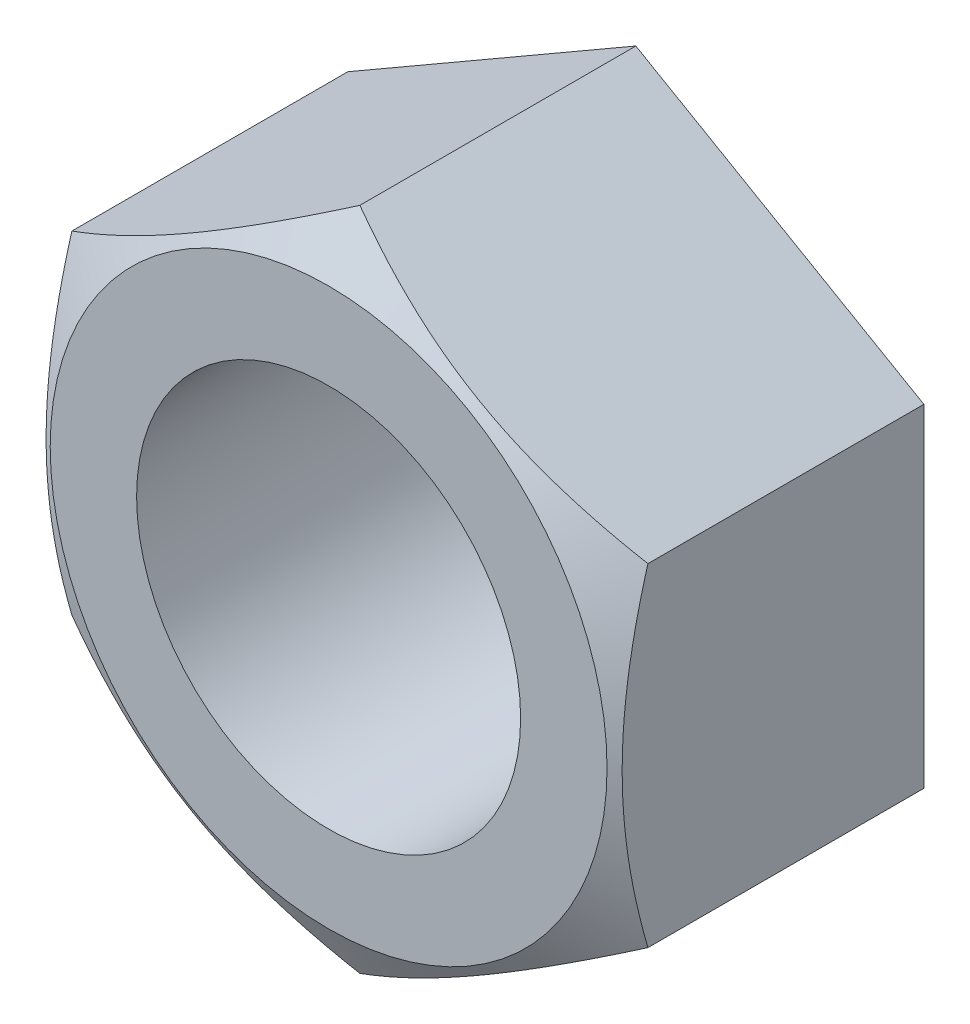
ISO-10303-21;
HEADER;
FILE_DESCRIPTION(('STEP AP214'),'2;1');
FILE_NAME('part.step','',(''),(''),'','','');
FILE_SCHEMA(('AUTOMOTIVE_DESIGN { 1 0 10303 214 1 1 1 1 }'));
ENDSEC;
DATA;
#1=APPLICATION_CONTEXT('core data for automotive mechanical design processes');
#2=APPLICATION_PROTOCOL_DEFINITION('international standard','automotive_design',2000,#1);
#3=PRODUCT_CONTEXT('',#1,'mechanical');
#4=PRODUCT('Part','Part','',(#3));
#5=PRODUCT_RELATED_PRODUCT_CATEGORY('part','',(#4));
#6=PRODUCT_DEFINITION_FORMATION('','',#4);
#7=PRODUCT_DEFINITION_CONTEXT('part definition',#1,'design');
#8=PRODUCT_DEFINITION('design','',#6,#7);
#9=PRODUCT_DEFINITION_SHAPE('','',#8);
#10=(LENGTH_UNIT() NAMED_UNIT(*) SI_UNIT(.MILLI.,.METRE.));
#11=(NAMED_UNIT(*) PLANE_ANGLE_UNIT() SI_UNIT($,.RADIAN.));
#12=(NAMED_UNIT(*) SI_UNIT($,.STERADIAN.) SOLID_ANGLE_UNIT());
#13=UNCERTAINTY_MEASURE_WITH_UNIT(LENGTH_MEASURE(1.E-05),#10,'distance_accuracy_value','');
#14=(GEOMETRIC_REPRESENTATION_CONTEXT(3) GLOBAL_UNCERTAINTY_ASSIGNED_CONTEXT((#13)) GLOBAL_UNIT_ASSIGNED_CONTEXT((#10,
#11,#12)) REPRESENTATION_CONTEXT('',''));
#15=CARTESIAN_POINT('',(0.,0.,0.));
#16=DIRECTION('',(0.,0.,1.));
#17=DIRECTION('',(1.,0.,0.));
#18=AXIS2_PLACEMENT_3D('',#15,#16,#17);
#19=CARTESIAN_POINT('',(30.,0.,16.));
#20=DIRECTION('',(0.,0.,-1.));
#21=DIRECTION('',(-1.,0.,0.));
#22=AXIS2_PLACEMENT_3D('',#19,#20,#21);
#23=PLANE('',#22);
#24=CARTESIAN_POINT('',(0.,0.,16.));
#25=DIRECTION('',(0.,0.,-1.));
#26=DIRECTION('',(-1.,0.,0.));
#27=AXIS2_PLACEMENT_3D('',#24,#25,#26);
#28=CIRCLE('',#27,14.5);
#29=CARTESIAN_POINT('',(-14.5,0.,16.));
#30=VERTEX_POINT('',#29);
#31=EDGE_CURVE('E171',#30,#30,#28,.T.);
#32=ORIENTED_EDGE('',*,*,#31,.F.);
#33=EDGE_LOOP('',(#32));
#34=FACE_BOUND('',#33,.T.);
#35=CARTESIAN_POINT('',(0.,0.,16.));
#36=DIRECTION('',(0.,0.,1.));
#37=DIRECTION('',(1.,0.,0.));
#38=AXIS2_PLACEMENT_3D('',#35,#36,#37);
#39=CIRCLE('',#38,10.);
#40=CARTESIAN_POINT('',(10.,0.,16.));
#41=VERTEX_POINT('',#40);
#42=EDGE_CURVE('E112',#41,#41,#39,.T.);
#43=ORIENTED_EDGE('',*,*,#42,.F.);
#44=EDGE_LOOP('',(#43));
#45=FACE_BOUND('',#44,.T.);
#46=ADVANCED_FACE('F14',(#34,#45),#23,.F.);
#47=CARTESIAN_POINT('',(30.,0.,0.));
#48=DIRECTION('',(0.,0.,-1.));
#49=DIRECTION('',(-1.,0.,0.));
#50=AXIS2_PLACEMENT_3D('',#47,#48,#49);
#51=PLANE('',#50);
#52=DIRECTION('',(-0.866025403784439,0.5,0.));
#53=VECTOR('',#52,1.);
#54=CARTESIAN_POINT('',(15.,8.6602540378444,0.));
#55=LINE('',#54,#53);
#56=CARTESIAN_POINT('',(15.,8.6602540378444,0.));
#57=VERTEX_POINT('',#56);
#58=CARTESIAN_POINT('',(0.,17.3205080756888,0.));
#59=VERTEX_POINT('',#58);
#60=EDGE_CURVE('E107',#57,#59,#55,.T.);
#61=ORIENTED_EDGE('',*,*,#60,.F.);
#62=DIRECTION('',(0.,1.,0.));
#63=VECTOR('',#62,1.);
#64=CARTESIAN_POINT('',(15.,-8.66025403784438,0.));
#65=LINE('',#64,#63);
#66=CARTESIAN_POINT('',(15.,-8.66025403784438,0.));
#67=VERTEX_POINT('',#66);
#68=EDGE_CURVE('E83',#67,#57,#65,.T.);
#69=ORIENTED_EDGE('',*,*,#68,.F.);
#70=DIRECTION('',(0.866025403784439,0.5,0.));
#71=VECTOR('',#70,1.);
#72=CARTESIAN_POINT('',(0.,-17.3205080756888,0.));
#73=LINE('',#72,#71);
#74=CARTESIAN_POINT('',(0.,-17.3205080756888,0.));
#75=VERTEX_POINT('',#74);
#76=EDGE_CURVE('E89',#75,#67,#73,.T.);
#77=ORIENTED_EDGE('',*,*,#76,.F.);
#78=DIRECTION('',(0.866025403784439,-0.5,0.));
#79=VECTOR('',#78,1.);
#80=CARTESIAN_POINT('',(-15.,-8.66025403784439,0.));
#81=LINE('',#80,#79);
#82=CARTESIAN_POINT('',(-15.,-8.66025403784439,0.));
#83=VERTEX_POINT('',#82);
#84=EDGE_CURVE('E119',#83,#75,#81,.T.);
#85=ORIENTED_EDGE('',*,*,#84,.F.);
#86=DIRECTION('',(0.,-1.,0.));
#87=VECTOR('',#86,1.);
#88=CARTESIAN_POINT('',(-15.,8.66025403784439,0.));
#89=LINE('',#88,#87);
#90=CARTESIAN_POINT('',(-15.,8.66025403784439,0.));
#91=VERTEX_POINT('',#90);
#92=EDGE_CURVE('E110',#91,#83,#89,.T.);
#93=ORIENTED_EDGE('',*,*,#92,.F.);
#94=DIRECTION('',(-0.866025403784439,-0.5,0.));
#95=VECTOR('',#94,1.);
#96=CARTESIAN_POINT('',(0.,17.3205080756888,0.));
#97=LINE('',#96,#95);
#98=EDGE_CURVE('E102',#59,#91,#97,.T.);
#99=ORIENTED_EDGE('',*,*,#98,.F.);
#100=EDGE_LOOP('',(#61,#69,#77,#85,#93,#99));
#101=FACE_BOUND('',#100,.T.);
#102=CARTESIAN_POINT('',(0.,0.,0.));
#103=DIRECTION('',(0.,0.,1.));
#104=DIRECTION('',(1.,0.,0.));
#105=AXIS2_PLACEMENT_3D('',#102,#103,#104);
#106=CIRCLE('',#105,10.);
#107=CARTESIAN_POINT('',(10.,0.,0.));
#108=VERTEX_POINT('',#107);
#109=EDGE_CURVE('E78',#108,#108,#106,.T.);
#110=ORIENTED_EDGE('',*,*,#109,.T.);
#111=EDGE_LOOP('',(#110));
#112=FACE_BOUND('',#111,.T.);
#113=ADVANCED_FACE('F105',(#101,#112),#51,.T.);
#114=CARTESIAN_POINT('',(15.,8.6602540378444,16.));
#115=DIRECTION('',(-0.5,-0.866025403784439,0.));
#116=DIRECTION('',(0.866025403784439,-0.5,0.));
#117=AXIS2_PLACEMENT_3D('',#114,#115,#116);
#118=PLANE('',#117);
#119=DIRECTION('',(0.,0.,-1.));
#120=VECTOR('',#119,1.);
#121=CARTESIAN_POINT('',(0.,17.3205080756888,16.));
#122=LINE('',#121,#120);
#123=CARTESIAN_POINT('',(0.,17.3205080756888,14.3715789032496));
#124=VERTEX_POINT('',#123);
#125=EDGE_CURVE('E29',#124,#59,#122,.T.);
#126=ORIENTED_EDGE('',*,*,#125,.F.);
#127=CARTESIAN_POINT('',(-0.000199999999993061,17.3206235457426,14.3715122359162));
#128=CARTESIAN_POINT('',(0.32949410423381,17.130274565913,14.4814030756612));
#129=CARTESIAN_POINT('',(0.660474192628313,16.939183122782,14.5863072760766));
#130=CARTESIAN_POINT('',(1.32508844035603,16.5554679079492,14.7847562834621));
#131=CARTESIAN_POINT('',(1.65872343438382,16.3628436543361,14.8782973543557));
#132=CARTESIAN_POINT('',(2.32929228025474,15.9756905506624,15.0527627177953));
#133=CARTESIAN_POINT('',(2.66623200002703,15.7811583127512,15.133657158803));
#134=CARTESIAN_POINT('',(3.3424527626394,15.3907420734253,15.2810922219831));
#135=CARTESIAN_POINT('',(3.68173367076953,15.1948581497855,15.3476336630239));
#136=CARTESIAN_POINT('',(4.35394314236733,14.8067578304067,15.4635324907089));
#137=CARTESIAN_POINT('',(4.68682180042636,14.6145702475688,15.5132734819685));
#138=CARTESIAN_POINT('',(5.35410443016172,14.2293144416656,15.5966781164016));
#139=CARTESIAN_POINT('',(5.68850843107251,14.0362462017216,15.6303414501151));
#140=CARTESIAN_POINT('',(6.35787818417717,13.6497853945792,15.6807407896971));
#141=CARTESIAN_POINT('',(6.69284279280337,13.4563934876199,15.6974969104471));
#142=CARTESIAN_POINT('',(7.36308121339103,13.0694311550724,15.7137214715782));
#143=CARTESIAN_POINT('',(7.69835501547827,12.8758607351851,15.7131904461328));
#144=CARTESIAN_POINT('',(8.32514688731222,12.5139822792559,15.696048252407));
#145=CARTESIAN_POINT('',(8.61670962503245,12.3456484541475,15.6815280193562));
#146=CARTESIAN_POINT('',(9.1991644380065,12.0093680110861,15.6396877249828));
#147=CARTESIAN_POINT('',(9.4900564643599,11.8414214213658,15.6123667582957));
#148=CARTESIAN_POINT('',(10.0710118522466,11.5060066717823,15.5454013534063));
#149=CARTESIAN_POINT('',(10.3610743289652,11.338539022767,15.5057467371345));
#150=CARTESIAN_POINT('',(10.9398394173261,11.0043888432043,15.4148097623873));
#151=CARTESIAN_POINT('',(11.2285419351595,10.8377063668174,15.3635266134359));
#152=CARTESIAN_POINT('',(12.1049144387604,10.3317324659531,15.1909380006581));
#153=CARTESIAN_POINT('',(12.6900465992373,9.99390625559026,15.0524236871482));
#154=CARTESIAN_POINT('',(13.8515859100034,9.32329122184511,14.73805289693));
#155=CARTESIAN_POINT('',(14.4280079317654,8.99049381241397,14.5622702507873));
#156=CARTESIAN_POINT('',(15.0002,8.66013856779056,14.3715122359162));
#157=B_SPLINE_CURVE_WITH_KNOTS('',3,(#127,#128,#129,#130,#131,#132,#133,#134,#135,#136,#137,
#138,#139,#140,#141,#142,#143,#144,#145,#146,#147,#148,#149,#150,#151,#152,#153,#154,#155,#156),
.UNSPECIFIED.,.F.,.F.,(4,2,2,2,2,2,2,2,2,2,2,2,2,2,4),(0.,1.18875411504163,2.37789802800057,
3.56980778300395,4.76164951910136,5.92407379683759,7.08652044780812,8.24758247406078,
9.40860862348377,10.4193068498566,11.4300765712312,12.4416826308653,13.4533574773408,
15.5211962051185,17.584976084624),.UNSPECIFIED.);
#158=CARTESIAN_POINT('',(15.,8.6602540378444,14.3715789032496));
#159=VERTEX_POINT('',#158);
#160=EDGE_CURVE('E73',#124,#159,#157,.T.);
#161=ORIENTED_EDGE('',*,*,#160,.T.);
#162=DIRECTION('',(0.,0.,-1.));
#163=VECTOR('',#162,1.);
#164=CARTESIAN_POINT('',(15.,8.6602540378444,16.));
#165=LINE('',#164,#163);
#166=EDGE_CURVE('E43',#159,#57,#165,.T.);
#167=ORIENTED_EDGE('',*,*,#166,.T.);
#168=ORIENTED_EDGE('',*,*,#60,.T.);
#169=EDGE_LOOP('',(#126,#161,#167,#168));
#170=FACE_BOUND('',#169,.T.);
#171=ADVANCED_FACE('F16',(#170),#118,.F.);
#172=CARTESIAN_POINT('',(0.,17.3205080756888,16.));
#173=DIRECTION('',(0.5,-0.866025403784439,0.));
#174=DIRECTION('',(0.866025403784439,0.5,0.));
#175=AXIS2_PLACEMENT_3D('',#172,#173,#174);
#176=PLANE('',#175);
#177=DIRECTION('',(0.,0.,-1.));
#178=VECTOR('',#177,1.);
#179=CARTESIAN_POINT('',(-15.,8.66025403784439,16.));
#180=LINE('',#179,#178);
#181=CARTESIAN_POINT('',(-15.,8.66025403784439,14.3715789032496));
#182=VERTEX_POINT('',#181);
#183=EDGE_CURVE('E96',#182,#91,#180,.T.);
#184=ORIENTED_EDGE('',*,*,#183,.F.);
#185=CARTESIAN_POINT('',(-15.0002,8.66013856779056,14.3715122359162));
#186=CARTESIAN_POINT('',(-14.6705058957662,8.85048754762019,14.4814030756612));
#187=CARTESIAN_POINT('',(-14.3395258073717,9.04157899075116,14.5863072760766));
#188=CARTESIAN_POINT('',(-13.674911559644,9.42529420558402,14.7847562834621));
#189=CARTESIAN_POINT('',(-13.3412765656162,9.61791845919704,14.8782973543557));
#190=CARTESIAN_POINT('',(-12.6707077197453,10.0050715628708,15.0527627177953));
#191=CARTESIAN_POINT('',(-12.333767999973,10.199603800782,15.133657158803));
#192=CARTESIAN_POINT('',(-11.6575472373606,10.5900200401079,15.2810922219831));
#193=CARTESIAN_POINT('',(-11.3182663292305,10.7859039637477,15.3476336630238));
#194=CARTESIAN_POINT('',(-10.6460568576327,11.1740042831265,15.4635324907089));
#195=CARTESIAN_POINT('',(-10.3131781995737,11.3661918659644,15.5132734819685));
#196=CARTESIAN_POINT('',(-9.6458955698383,11.7514476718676,15.5966781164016));
#197=CARTESIAN_POINT('',(-9.3114915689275,11.9445159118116,15.6303414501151));
#198=CARTESIAN_POINT('',(-8.64212181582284,12.3309767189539,15.6807407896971));
#199=CARTESIAN_POINT('',(-8.30715720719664,12.5243686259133,15.6974969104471));
#200=CARTESIAN_POINT('',(-7.63691878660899,12.9113309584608,15.7137214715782));
#201=CARTESIAN_POINT('',(-7.30164498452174,13.1049013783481,15.7131904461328));
#202=CARTESIAN_POINT('',(-6.67485311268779,13.4667798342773,15.696048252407));
#203=CARTESIAN_POINT('',(-6.38329037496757,13.6351136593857,15.6815280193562));
#204=CARTESIAN_POINT('',(-5.80083556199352,13.9713941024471,15.6396877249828));
#205=CARTESIAN_POINT('',(-5.50994353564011,14.1393406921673,15.6123667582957));
#206=CARTESIAN_POINT('',(-4.92898814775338,14.4747554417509,15.5454013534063));
#207=CARTESIAN_POINT('',(-4.63892567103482,14.6422230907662,15.5057467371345));
#208=CARTESIAN_POINT('',(-4.06016058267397,14.9763732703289,15.4148097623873));
#209=CARTESIAN_POINT('',(-3.77145806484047,15.1430557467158,15.3635266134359));
#210=CARTESIAN_POINT('',(-2.8950855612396,15.6490296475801,15.1909380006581));
#211=CARTESIAN_POINT('',(-2.30995340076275,15.9868558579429,15.0524236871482));
#212=CARTESIAN_POINT('',(-1.14841408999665,16.6574708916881,14.73805289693));
#213=CARTESIAN_POINT('',(-0.57199206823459,16.9902683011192,14.5622702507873));
#214=CARTESIAN_POINT('',(0.000200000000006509,17.3206235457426,14.3715122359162));
#215=B_SPLINE_CURVE_WITH_KNOTS('',3,(#185,#186,#187,#188,#189,#190,#191,#192,#193,#194,#195,
#196,#197,#198,#199,#200,#201,#202,#203,#204,#205,#206,#207,#208,#209,#210,#211,#212,#213,#214),
.UNSPECIFIED.,.F.,.F.,(4,2,2,2,2,2,2,2,2,2,2,2,2,2,4),(0.,1.18875411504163,2.37789802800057,
3.56980778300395,4.76164951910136,5.9240737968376,7.08652044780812,8.24758247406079,
9.40860862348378,10.4193068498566,11.4300765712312,12.4416826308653,13.4533574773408,
15.5211962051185,17.5849760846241),.UNSPECIFIED.);
#216=EDGE_CURVE('E79',#182,#124,#215,.T.);
#217=ORIENTED_EDGE('',*,*,#216,.T.);
#218=ORIENTED_EDGE('',*,*,#125,.T.);
#219=ORIENTED_EDGE('',*,*,#98,.T.);
#220=EDGE_LOOP('',(#184,#217,#218,#219));
#221=FACE_BOUND('',#220,.T.);
#222=ADVANCED_FACE('F101',(#221),#176,.F.);
#223=CARTESIAN_POINT('',(-15.,8.66025403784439,16.));
#224=DIRECTION('',(1.,0.,0.));
#225=DIRECTION('',(0.,1.,0.));
#226=AXIS2_PLACEMENT_3D('',#223,#224,#225);
#227=PLANE('',#226);
#228=DIRECTION('',(0.,0.,-1.));
#229=VECTOR('',#228,1.);
#230=CARTESIAN_POINT('',(-15.,-8.66025403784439,16.));
#231=LINE('',#230,#229);
#232=CARTESIAN_POINT('',(-15.,-8.66025403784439,14.3715789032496));
#233=VERTEX_POINT('',#232);
#234=EDGE_CURVE('E94',#233,#83,#231,.T.);
#235=ORIENTED_EDGE('',*,*,#234,.F.);
#236=CARTESIAN_POINT('',(-15.,-23.1336360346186,8.45340149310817));
#237=CARTESIAN_POINT('',(-15.,-22.8066069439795,8.61182037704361));
#238=CARTESIAN_POINT('',(-15.,-22.4791905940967,8.76943944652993));
#239=CARTESIAN_POINT('',(-15.,-21.8235025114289,9.08289654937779));
#240=CARTESIAN_POINT('',(-15.,-21.4952307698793,9.23873456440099));
#241=CARTESIAN_POINT('',(-15.,-20.5089219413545,9.70334683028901));
#242=CARTESIAN_POINT('',(-15.,-19.8494900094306,10.009171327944));
#243=CARTESIAN_POINT('',(-15.,-18.5225189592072,10.6127544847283));
#244=CARTESIAN_POINT('',(-15.,-17.8549551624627,10.9104590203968));
#245=CARTESIAN_POINT('',(-15.,-16.5144732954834,11.4935162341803));
#246=CARTESIAN_POINT('',(-15.,-15.8415554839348,11.7788695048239));
#247=CARTESIAN_POINT('',(-15.,-14.4680838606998,12.3426582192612));
#248=CARTESIAN_POINT('',(-15.,-13.767324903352,12.6205965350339));
#249=CARTESIAN_POINT('',(-15.,-12.3575560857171,13.155124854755));
#250=CARTESIAN_POINT('',(-15.,-11.6485453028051,13.4117124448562));
#251=CARTESIAN_POINT('',(-15.,-10.222537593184,13.8967051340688));
#252=CARTESIAN_POINT('',(-15.,-9.50556061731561,14.1251684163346));
#253=CARTESIAN_POINT('',(-15.,-8.06125491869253,14.5465087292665));
#254=CARTESIAN_POINT('',(-15.,-7.33392957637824,14.7393971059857));
#255=CARTESIAN_POINT('',(-15.,-6.23706647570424,14.9944809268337));
#256=CARTESIAN_POINT('',(-15.,-5.87144774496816,15.0736350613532));
#257=CARTESIAN_POINT('',(-15.,-5.13773657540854,15.2195711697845));
#258=CARTESIAN_POINT('',(-15.,-4.76964418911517,15.2863534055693));
#259=CARTESIAN_POINT('',(-15.,-4.03124752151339,15.4063593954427));
#260=CARTESIAN_POINT('',(-15.,-3.66094325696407,15.4595832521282));
#261=CARTESIAN_POINT('',(-15.,-2.91852885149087,15.5514055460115));
#262=CARTESIAN_POINT('',(-15.,-2.54641878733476,15.5900045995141));
#263=CARTESIAN_POINT('',(-15.,-1.80571200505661,15.6513340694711));
#264=CARTESIAN_POINT('',(-15.,-1.43713178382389,15.6742625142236));
#265=CARTESIAN_POINT('',(-15.,-0.699333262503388,15.7045210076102));
#266=CARTESIAN_POINT('',(-15.,-0.33011497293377,15.7118513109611));
#267=CARTESIAN_POINT('',(-15.,0.40830297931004,15.7107395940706));
#268=CARTESIAN_POINT('',(-15.,0.77750264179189,15.702297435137));
#269=CARTESIAN_POINT('',(-15.,1.51522068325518,15.6698444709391));
#270=CARTESIAN_POINT('',(-15.,1.88373903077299,15.6458329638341));
#271=CARTESIAN_POINT('',(-15.,2.77334317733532,15.5695808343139));
#272=CARTESIAN_POINT('',(-15.,3.29378822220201,15.5097345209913));
#273=CARTESIAN_POINT('',(-15.,4.33073335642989,15.3622796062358));
#274=CARTESIAN_POINT('',(-15.,4.84723288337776,15.2746671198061));
#275=CARTESIAN_POINT('',(-15.,5.87582288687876,15.0747967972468));
#276=CARTESIAN_POINT('',(-15.,6.38790951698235,14.9625193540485));
#277=CARTESIAN_POINT('',(-15.,7.40690593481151,14.7167377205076));
#278=CARTESIAN_POINT('',(-15.,7.913815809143,14.5832338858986));
#279=CARTESIAN_POINT('',(-15.,8.93353060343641,14.2951058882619));
#280=CARTESIAN_POINT('',(-15.,9.44622237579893,14.140084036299));
#281=CARTESIAN_POINT('',(-15.,10.466554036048,13.8143054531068));
#282=CARTESIAN_POINT('',(-15.,10.9741938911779,13.6435486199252));
#283=CARTESIAN_POINT('',(-15.,11.9846775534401,13.288986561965));
#284=CARTESIAN_POINT('',(-15.,12.4875229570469,13.1051858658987));
#285=CARTESIAN_POINT('',(-15.,13.4890659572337,12.726670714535));
#286=CARTESIAN_POINT('',(-15.,13.9877635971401,12.5319563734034));
#287=CARTESIAN_POINT('',(-15.,15.1427540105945,12.0687529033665));
#288=CARTESIAN_POINT('',(-15.,15.7976671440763,11.7968293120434));
#289=CARTESIAN_POINT('',(-15.,17.1021103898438,11.2403281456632));
#290=CARTESIAN_POINT('',(-15.,17.7516402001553,10.9557498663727));
#291=CARTESIAN_POINT('',(-15.,19.0462911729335,10.3764140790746));
#292=CARTESIAN_POINT('',(-15.,19.6914114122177,10.0816545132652));
#293=CARTESIAN_POINT('',(-15.,20.9778293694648,9.48395972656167));
#294=CARTESIAN_POINT('',(-15.,21.6191271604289,9.18102466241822));
#295=CARTESIAN_POINT('',(-15.,22.8991721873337,8.56816073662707));
#296=CARTESIAN_POINT('',(-15.,23.5379161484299,8.25822504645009));
#297=CARTESIAN_POINT('',(-15.,24.8126945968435,7.63283206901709));
#298=CARTESIAN_POINT('',(-15.,25.4487290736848,7.31737476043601));
#299=CARTESIAN_POINT('',(-15.,26.7184215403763,6.68190299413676));
#300=CARTESIAN_POINT('',(-15.,27.3520798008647,6.36188907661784));
#301=CARTESIAN_POINT('',(-15.,28.6174316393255,5.71799823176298));
#302=CARTESIAN_POINT('',(-15.,29.2491252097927,5.39412128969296));
#303=CARTESIAN_POINT('',(-15.,31.0395274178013,4.47031672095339));
#304=CARTESIAN_POINT('',(-15.,32.1962377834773,3.86651625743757));
#305=CARTESIAN_POINT('',(-15.,34.5053471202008,2.65065654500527));
#306=CARTESIAN_POINT('',(-15.,35.6577459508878,2.0385970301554));
#307=CARTESIAN_POINT('',(-15.,37.9564513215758,0.809571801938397));
#308=CARTESIAN_POINT('',(-15.,39.1027658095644,0.19262094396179));
#309=CARTESIAN_POINT('',(-15.,40.8201927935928,-0.736509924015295));
#310=CARTESIAN_POINT('',(-15.,41.392313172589,-1.04682972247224));
#311=CARTESIAN_POINT('',(-15.,42.5359480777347,-1.66858168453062));
#312=CARTESIAN_POINT('',(-15.,43.1074626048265,-1.98001384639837));
#313=CARTESIAN_POINT('',(-15.,43.6787080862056,-2.29193886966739));
#314=B_SPLINE_CURVE_WITH_KNOTS('',3,(#236,#237,#238,#239,#240,#241,#242,#243,#244,#245,#246,
#247,#248,#249,#250,#251,#252,#253,#254,#255,#256,#257,#258,#259,#260,#261,#262,#263,#264,#265,
#266,#267,#268,#269,#270,#271,#272,#273,#274,#275,#276,#277,#278,#279,#280,#281,#282,#283,#284,
#285,#286,#287,#288,#289,#290,#291,#292,#293,#294,#295,#296,#297,#298,#299,#300,#301,#302,#303,
#304,#305,#306,#307,#308,#309,#310,#311,#312,#313),.UNSPECIFIED.,.F.,.F.,(4,2,2,2,2,2,2,2,2,2,2,
2,2,2,2,2,2,2,2,2,2,2,2,2,2,2,2,2,2,2,2,2,2,2,2,2,2,2,4),(0.,1.09013610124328,2.18028341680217,
4.36090741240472,6.55362205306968,8.7462313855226,11.0075615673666,13.2691470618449,
15.5259722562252,17.7820764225,18.904167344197,20.0262345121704,21.1482931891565,
22.2703045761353,23.377861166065,24.4853996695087,25.5929479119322,26.7005460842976,
28.2712979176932,29.8422696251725,31.4144947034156,32.9866934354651,34.5932393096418,
36.1997955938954,37.8057967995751,39.4117812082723,41.5389682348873,43.6662737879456,
45.794011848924,47.9217091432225,50.0515800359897,52.1814591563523,54.3110878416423,
56.4407246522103,60.3551327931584,64.2696672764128,68.1750299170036,70.1276121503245,
72.0801913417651),.UNSPECIFIED.);
#315=EDGE_CURVE('E134',#233,#182,#314,.T.);
#316=ORIENTED_EDGE('',*,*,#315,.T.);
#317=ORIENTED_EDGE('',*,*,#183,.T.);
#318=ORIENTED_EDGE('',*,*,#92,.T.);
#319=EDGE_LOOP('',(#235,#316,#317,#318));
#320=FACE_BOUND('',#319,.T.);
#321=ADVANCED_FACE('F133',(#320),#227,.F.);
#322=CARTESIAN_POINT('',(-15.,-8.66025403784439,16.));
#323=DIRECTION('',(0.5,0.866025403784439,0.));
#324=DIRECTION('',(-0.866025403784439,0.5,0.));
#325=AXIS2_PLACEMENT_3D('',#322,#323,#324);
#326=PLANE('',#325);
#327=DIRECTION('',(0.,0.,-1.));
#328=VECTOR('',#327,1.);
#329=CARTESIAN_POINT('',(0.,-17.3205080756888,16.));
#330=LINE('',#329,#328);
#331=CARTESIAN_POINT('',(0.,-17.3205080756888,14.3715789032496));
#332=VERTEX_POINT('',#331);
#333=EDGE_CURVE('E87',#332,#75,#330,.T.);
#334=ORIENTED_EDGE('',*,*,#333,.F.);
#335=CARTESIAN_POINT('',(0.000199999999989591,-17.3206235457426,14.3715122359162));
#336=CARTESIAN_POINT('',(-0.32949410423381,-17.130274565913,14.4814030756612));
#337=CARTESIAN_POINT('',(-0.660474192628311,-16.939183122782,14.5863072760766));
#338=CARTESIAN_POINT('',(-1.32508844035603,-16.5554679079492,14.7847562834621));
#339=CARTESIAN_POINT('',(-1.65872343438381,-16.3628436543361,14.8782973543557));
#340=CARTESIAN_POINT('',(-2.32929228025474,-15.9756905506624,15.0527627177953));
#341=CARTESIAN_POINT('',(-2.66623200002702,-15.7811583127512,15.133657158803));
#342=CARTESIAN_POINT('',(-3.3424527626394,-15.3907420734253,15.2810922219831));
#343=CARTESIAN_POINT('',(-3.68173367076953,-15.1948581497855,15.3476336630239));
#344=CARTESIAN_POINT('',(-4.35394314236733,-14.8067578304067,15.4635324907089));
#345=CARTESIAN_POINT('',(-4.68682180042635,-14.6145702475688,15.5132734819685));
#346=CARTESIAN_POINT('',(-5.35410443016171,-14.2293144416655,15.5966781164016));
#347=CARTESIAN_POINT('',(-5.68850843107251,-14.0362462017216,15.6303414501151));
#348=CARTESIAN_POINT('',(-6.35787818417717,-13.6497853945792,15.6807407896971));
#349=CARTESIAN_POINT('',(-6.69284279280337,-13.4563934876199,15.6974969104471));
#350=CARTESIAN_POINT('',(-7.36308121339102,-13.0694311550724,15.7137214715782));
#351=CARTESIAN_POINT('',(-7.69835501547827,-12.8758607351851,15.7131904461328));
#352=CARTESIAN_POINT('',(-8.32514688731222,-12.5139822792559,15.696048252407));
#353=CARTESIAN_POINT('',(-8.61670962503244,-12.3456484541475,15.6815280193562));
#354=CARTESIAN_POINT('',(-9.1991644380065,-12.0093680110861,15.6396877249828));
#355=CARTESIAN_POINT('',(-9.4900564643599,-11.8414214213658,15.6123667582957));
#356=CARTESIAN_POINT('',(-10.0710118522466,-11.5060066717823,15.5454013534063));
#357=CARTESIAN_POINT('',(-10.3610743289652,-11.338539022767,15.5057467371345));
#358=CARTESIAN_POINT('',(-10.939839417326,-11.0043888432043,15.4148097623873));
#359=CARTESIAN_POINT('',(-11.2285419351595,-10.8377063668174,15.3635266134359));
#360=CARTESIAN_POINT('',(-12.1049144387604,-10.3317324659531,15.1909380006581));
#361=CARTESIAN_POINT('',(-12.6900465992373,-9.99390625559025,15.0524236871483));
#362=CARTESIAN_POINT('',(-13.8515859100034,-9.3232912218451,14.73805289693));
#363=CARTESIAN_POINT('',(-14.4280079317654,-8.99049381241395,14.5622702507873));
#364=CARTESIAN_POINT('',(-15.0002,-8.66013856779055,14.3715122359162));
#365=B_SPLINE_CURVE_WITH_KNOTS('',3,(#335,#336,#337,#338,#339,#340,#341,#342,#343,#344,#345,
#346,#347,#348,#349,#350,#351,#352,#353,#354,#355,#356,#357,#358,#359,#360,#361,#362,#363,#364),
.UNSPECIFIED.,.F.,.F.,(4,2,2,2,2,2,2,2,2,2,2,2,2,2,4),(0.,1.18875411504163,2.37789802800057,
3.56980778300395,4.76164951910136,5.92407379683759,7.08652044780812,8.24758247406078,
9.40860862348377,10.4193068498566,11.4300765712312,12.4416826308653,13.4533574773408,
15.5211962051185,17.5849760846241),.UNSPECIFIED.);
#366=EDGE_CURVE('E130',#332,#233,#365,.T.);
#367=ORIENTED_EDGE('',*,*,#366,.T.);
#368=ORIENTED_EDGE('',*,*,#234,.T.);
#369=ORIENTED_EDGE('',*,*,#84,.T.);
#370=EDGE_LOOP('',(#334,#367,#368,#369));
#371=FACE_BOUND('',#370,.T.);
#372=ADVANCED_FACE('F127',(#371),#326,.F.);
#373=CARTESIAN_POINT('',(0.,-17.3205080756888,16.));
#374=DIRECTION('',(-0.5,0.866025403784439,0.));
#375=DIRECTION('',(-0.866025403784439,-0.5,0.));
#376=AXIS2_PLACEMENT_3D('',#373,#374,#375);
#377=PLANE('',#376);
#378=DIRECTION('',(0.,0.,-1.));
#379=VECTOR('',#378,1.);
#380=CARTESIAN_POINT('',(15.,-8.66025403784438,16.));
#381=LINE('',#380,#379);
#382=CARTESIAN_POINT('',(15.,-8.66025403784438,14.3715789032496));
#383=VERTEX_POINT('',#382);
#384=EDGE_CURVE('E85',#383,#67,#381,.T.);
#385=ORIENTED_EDGE('',*,*,#384,.F.);
#386=CARTESIAN_POINT('',(15.0002,-8.66013856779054,14.3715122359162));
#387=CARTESIAN_POINT('',(14.6705058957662,-8.85048754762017,14.4814030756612));
#388=CARTESIAN_POINT('',(14.3395258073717,-9.04157899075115,14.5863072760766));
#389=CARTESIAN_POINT('',(13.674911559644,-9.42529420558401,14.7847562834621));
#390=CARTESIAN_POINT('',(13.3412765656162,-9.61791845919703,14.8782973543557));
#391=CARTESIAN_POINT('',(12.6707077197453,-10.0050715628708,15.0527627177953));
#392=CARTESIAN_POINT('',(12.333767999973,-10.199603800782,15.133657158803));
#393=CARTESIAN_POINT('',(11.6575472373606,-10.5900200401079,15.2810922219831));
#394=CARTESIAN_POINT('',(11.3182663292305,-10.7859039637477,15.3476336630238));
#395=CARTESIAN_POINT('',(10.6460568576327,-11.1740042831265,15.4635324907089));
#396=CARTESIAN_POINT('',(10.3131781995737,-11.3661918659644,15.5132734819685));
#397=CARTESIAN_POINT('',(9.64589556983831,-11.7514476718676,15.5966781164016));
#398=CARTESIAN_POINT('',(9.31149156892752,-11.9445159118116,15.6303414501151));
#399=CARTESIAN_POINT('',(8.64212181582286,-12.3309767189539,15.6807407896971));
#400=CARTESIAN_POINT('',(8.30715720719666,-12.5243686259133,15.6974969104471));
#401=CARTESIAN_POINT('',(7.636918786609,-12.9113309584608,15.7137214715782));
#402=CARTESIAN_POINT('',(7.30164498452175,-13.1049013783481,15.7131904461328));
#403=CARTESIAN_POINT('',(6.67485311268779,-13.4667798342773,15.696048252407));
#404=CARTESIAN_POINT('',(6.38329037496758,-13.6351136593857,15.6815280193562));
#405=CARTESIAN_POINT('',(5.80083556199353,-13.9713941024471,15.6396877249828));
#406=CARTESIAN_POINT('',(5.50994353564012,-14.1393406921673,15.6123667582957));
#407=CARTESIAN_POINT('',(4.92898814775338,-14.4747554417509,15.5454013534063));
#408=CARTESIAN_POINT('',(4.63892567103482,-14.6422230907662,15.5057467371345));
#409=CARTESIAN_POINT('',(4.06016058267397,-14.9763732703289,15.4148097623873));
#410=CARTESIAN_POINT('',(3.77145806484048,-15.1430557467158,15.3635266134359));
#411=CARTESIAN_POINT('',(2.8950855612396,-15.6490296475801,15.1909380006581));
#412=CARTESIAN_POINT('',(2.30995340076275,-15.9868558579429,15.0524236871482));
#413=CARTESIAN_POINT('',(1.14841408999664,-16.6574708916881,14.73805289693));
#414=CARTESIAN_POINT('',(0.571992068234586,-16.9902683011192,14.5622702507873));
#415=CARTESIAN_POINT('',(-0.000200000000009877,-17.3206235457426,14.3715122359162));
#416=B_SPLINE_CURVE_WITH_KNOTS('',3,(#386,#387,#388,#389,#390,#391,#392,#393,#394,#395,#396,
#397,#398,#399,#400,#401,#402,#403,#404,#405,#406,#407,#408,#409,#410,#411,#412,#413,#414,#415),
.UNSPECIFIED.,.F.,.F.,(4,2,2,2,2,2,2,2,2,2,2,2,2,2,4),(0.,1.18875411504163,2.37789802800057,
3.56980778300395,4.76164951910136,5.92407379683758,7.08652044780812,8.24758247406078,
9.40860862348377,10.4193068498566,11.4300765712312,12.4416826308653,13.4533574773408,
15.5211962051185,17.5849760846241),.UNSPECIFIED.);
#417=EDGE_CURVE('E36',#383,#332,#416,.T.);
#418=ORIENTED_EDGE('',*,*,#417,.T.);
#419=ORIENTED_EDGE('',*,*,#333,.T.);
#420=ORIENTED_EDGE('',*,*,#76,.T.);
#421=EDGE_LOOP('',(#385,#418,#419,#420));
#422=FACE_BOUND('',#421,.T.);
#423=ADVANCED_FACE('F124',(#422),#377,.F.);
#424=CARTESIAN_POINT('',(15.,-8.66025403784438,16.));
#425=DIRECTION('',(-1.,0.,0.));
#426=DIRECTION('',(0.,-1.,0.));
#427=AXIS2_PLACEMENT_3D('',#424,#425,#426);
#428=PLANE('',#427);
#429=ORIENTED_EDGE('',*,*,#166,.F.);
#430=CARTESIAN_POINT('',(15.,-23.1336360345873,8.45340149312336));
#431=CARTESIAN_POINT('',(15.,-22.8066069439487,8.61182037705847));
#432=CARTESIAN_POINT('',(15.,-22.4791905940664,8.76943944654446));
#433=CARTESIAN_POINT('',(15.,-21.8235025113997,9.08289654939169));
#434=CARTESIAN_POINT('',(15.,-21.4952307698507,9.23873456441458));
#435=CARTESIAN_POINT('',(15.,-20.5089219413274,9.70334683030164));
#436=CARTESIAN_POINT('',(15.,-19.8494900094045,10.009171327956));
#437=CARTESIAN_POINT('',(15.,-18.5225189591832,10.612754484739));
#438=CARTESIAN_POINT('',(15.,-17.8549551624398,10.9104590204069));
#439=CARTESIAN_POINT('',(15.,-16.5144732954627,11.4935162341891));
#440=CARTESIAN_POINT('',(15.,-15.8415554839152,11.7788695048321));
#441=CARTESIAN_POINT('',(15.,-14.4680838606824,12.3426582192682));
#442=CARTESIAN_POINT('',(15.,-13.7673249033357,12.6205965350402));
#443=CARTESIAN_POINT('',(15.,-12.3575560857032,13.1551248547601));
#444=CARTESIAN_POINT('',(15.,-11.6485453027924,13.4117124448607));
#445=CARTESIAN_POINT('',(15.,-10.2225375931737,13.8967051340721));
#446=CARTESIAN_POINT('',(15.,-9.50556061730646,14.1251684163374));
#447=CARTESIAN_POINT('',(15.,-8.06125491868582,14.5465087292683));
#448=CARTESIAN_POINT('',(15.,-7.33392957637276,14.7393971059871));
#449=CARTESIAN_POINT('',(15.,-6.23706647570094,14.9944809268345));
#450=CARTESIAN_POINT('',(15.,-5.8714477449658,15.0736350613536));
#451=CARTESIAN_POINT('',(15.,-5.13773657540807,15.2195711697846));
#452=CARTESIAN_POINT('',(15.,-4.76964418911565,15.2863534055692));
#453=CARTESIAN_POINT('',(15.,-4.03124752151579,15.4063593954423));
#454=CARTESIAN_POINT('',(15.,-3.66094325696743,15.4595832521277));
#455=CARTESIAN_POINT('',(15.,-2.91852885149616,15.5514055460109));
#456=CARTESIAN_POINT('',(15.,-2.54641878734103,15.5900045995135));
#457=CARTESIAN_POINT('',(15.,-1.8057120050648,15.6513340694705));
#458=CARTESIAN_POINT('',(15.,-1.43713178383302,15.6742625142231));
#459=CARTESIAN_POINT('',(15.,-0.699333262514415,15.7045210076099));
#460=CARTESIAN_POINT('',(15.,-0.330114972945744,15.711851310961));
#461=CARTESIAN_POINT('',(15.,0.408302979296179,15.7107395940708));
#462=CARTESIAN_POINT('',(15.,0.777502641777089,15.7022974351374));
#463=CARTESIAN_POINT('',(15.,1.51522068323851,15.6698444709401));
#464=CARTESIAN_POINT('',(15.,1.8837390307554,15.6458329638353));
#465=CARTESIAN_POINT('',(15.,2.77334317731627,15.5695808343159));
#466=CARTESIAN_POINT('',(15.,3.29378822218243,15.5097345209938));
#467=CARTESIAN_POINT('',(15.,4.33073335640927,15.3622796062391));
#468=CARTESIAN_POINT('',(15.,4.84723288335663,15.2746671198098));
#469=CARTESIAN_POINT('',(15.,5.87582288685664,15.0747967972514));
#470=CARTESIAN_POINT('',(15.,6.38790951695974,14.9625193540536));
#471=CARTESIAN_POINT('',(15.,7.40690593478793,14.7167377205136));
#472=CARTESIAN_POINT('',(15.,7.91381580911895,14.5832338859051));
#473=CARTESIAN_POINT('',(15.,8.93353060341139,14.2951058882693));
#474=CARTESIAN_POINT('',(15.,9.44622237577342,14.1400840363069));
#475=CARTESIAN_POINT('',(15.,10.4665540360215,13.8143054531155));
#476=CARTESIAN_POINT('',(15.,10.9741938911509,13.6435486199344));
#477=CARTESIAN_POINT('',(15.,11.9846775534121,13.2889865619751));
#478=CARTESIAN_POINT('',(15.,12.4875229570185,13.1051858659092));
#479=CARTESIAN_POINT('',(15.,13.4890659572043,12.7266707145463));
#480=CARTESIAN_POINT('',(15.,13.9877635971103,12.5319563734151));
#481=CARTESIAN_POINT('',(15.,15.1427540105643,12.0687529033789));
#482=CARTESIAN_POINT('',(15.,15.7976671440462,11.796829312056));
#483=CARTESIAN_POINT('',(15.,17.102110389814,11.2403281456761));
#484=CARTESIAN_POINT('',(15.,17.7516402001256,10.9557498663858));
#485=CARTESIAN_POINT('',(15.,19.046291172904,10.376414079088));
#486=CARTESIAN_POINT('',(15.,19.6914114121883,10.0816545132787));
#487=CARTESIAN_POINT('',(15.,20.9778293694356,9.48395972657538));
#488=CARTESIAN_POINT('',(15.,21.6191271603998,9.18102466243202));
#489=CARTESIAN_POINT('',(15.,22.8991721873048,8.56816073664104));
#490=CARTESIAN_POINT('',(15.,23.5379161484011,8.25822504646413));
#491=CARTESIAN_POINT('',(15.,24.8126945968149,7.63283206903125));
#492=CARTESIAN_POINT('',(15.,25.4487290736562,7.31737476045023));
#493=CARTESIAN_POINT('',(15.,26.7184215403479,6.68190299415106));
#494=CARTESIAN_POINT('',(15.,27.3520798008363,6.36188907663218));
#495=CARTESIAN_POINT('',(15.,28.6174316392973,5.71799823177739));
#496=CARTESIAN_POINT('',(15.,29.2491252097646,5.39412128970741));
#497=CARTESIAN_POINT('',(15.,31.0395274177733,4.47031672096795));
#498=CARTESIAN_POINT('',(15.,32.1962377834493,3.86651625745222));
#499=CARTESIAN_POINT('',(15.,34.5053471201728,2.65065654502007));
#500=CARTESIAN_POINT('',(15.,35.6577459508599,2.03859703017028));
#501=CARTESIAN_POINT('',(15.,37.9564513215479,0.809571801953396));
#502=CARTESIAN_POINT('',(15.,39.1027658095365,0.192620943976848));
#503=CARTESIAN_POINT('',(15.,40.8201927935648,-0.736509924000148));
#504=CARTESIAN_POINT('',(15.,41.3923131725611,-1.04682972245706));
#505=CARTESIAN_POINT('',(15.,42.5359480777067,-1.66858168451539));
#506=CARTESIAN_POINT('',(15.,43.1074626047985,-1.98001384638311));
#507=CARTESIAN_POINT('',(15.,43.6787080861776,-2.29193886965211));
#508=B_SPLINE_CURVE_WITH_KNOTS('',3,(#430,#431,#432,#433,#434,#435,#436,#437,#438,#439,#440,
#441,#442,#443,#444,#445,#446,#447,#448,#449,#450,#451,#452,#453,#454,#455,#456,#457,#458,#459,
#460,#461,#462,#463,#464,#465,#466,#467,#468,#469,#470,#471,#472,#473,#474,#475,#476,#477,#478,
#479,#480,#481,#482,#483,#484,#485,#486,#487,#488,#489,#490,#491,#492,#493,#494,#495,#496,#497,
#498,#499,#500,#501,#502,#503,#504,#505,#506,#507),.UNSPECIFIED.,.F.,.F.,(4,2,2,2,2,2,2,2,2,2,2,
2,2,2,2,2,2,2,2,2,2,2,2,2,2,2,2,2,2,2,2,2,2,2,2,2,2,2,4),(0.,1.09013610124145,2.1802834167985,
4.36090741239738,6.55362205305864,8.74623138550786,11.007561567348,13.2691470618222,
15.5259722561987,17.7820764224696,18.9041673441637,20.0262345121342,21.1482931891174,
22.2703045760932,23.3778611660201,24.485399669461,25.5929479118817,26.7005460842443,
28.2712979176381,29.8422696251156,31.4144947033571,32.9866934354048,34.5932393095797,
36.1997955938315,37.8057967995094,39.4117812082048,41.5389682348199,43.6662737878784,
45.7940118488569,47.9217091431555,50.0515800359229,52.1814591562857,54.3110878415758,
56.4407246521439,60.355132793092,64.2696672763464,68.175029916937,70.1276121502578,
72.0801913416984),.UNSPECIFIED.);
#509=EDGE_CURVE('E9',#159,#383,#508,.F.);
#510=ORIENTED_EDGE('',*,*,#509,.T.);
#511=ORIENTED_EDGE('',*,*,#384,.T.);
#512=ORIENTED_EDGE('',*,*,#68,.T.);
#513=EDGE_LOOP('',(#429,#510,#511,#512));
#514=FACE_BOUND('',#513,.T.);
#515=ADVANCED_FACE('F81',(#514),#428,.F.);
#516=CARTESIAN_POINT('',(0.,0.,16.));
#517=DIRECTION('',(0.,0.,-1.));
#518=DIRECTION('',(-1.,0.,0.));
#519=AXIS2_PLACEMENT_3D('',#516,#517,#518);
#520=CYLINDRICAL_SURFACE('',#519,10.);
#521=ORIENTED_EDGE('',*,*,#42,.T.);
#522=EDGE_LOOP('',(#521));
#523=FACE_BOUND('',#522,.T.);
#524=ORIENTED_EDGE('',*,*,#109,.F.);
#525=EDGE_LOOP('',(#524));
#526=FACE_BOUND('',#525,.T.);
#527=ADVANCED_FACE('F157',(#523,#526),#520,.F.);
#528=CARTESIAN_POINT('',(0.,0.,16.));
#529=DIRECTION('',(0.,0.,-1.));
#530=DIRECTION('',(-1.,0.,0.));
#531=AXIS2_PLACEMENT_3D('',#528,#529,#530);
#532=CONICAL_SURFACE('',#531,14.5,1.0471975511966);
#533=ORIENTED_EDGE('',*,*,#31,.T.);
#534=EDGE_LOOP('',(#533));
#535=FACE_BOUND('',#534,.T.);
#536=ORIENTED_EDGE('',*,*,#216,.F.);
#537=ORIENTED_EDGE('',*,*,#315,.F.);
#538=ORIENTED_EDGE('',*,*,#366,.F.);
#539=ORIENTED_EDGE('',*,*,#417,.F.);
#540=ORIENTED_EDGE('',*,*,#509,.F.);
#541=ORIENTED_EDGE('',*,*,#160,.F.);
#542=EDGE_LOOP('',(#536,#537,#538,#539,#540,#541));
#543=FACE_BOUND('',#542,.T.);
#544=ADVANCED_FACE('F72',(#535,#543),#532,.T.);
#545=CLOSED_SHELL('',(#46,#113,#171,#222,#321,#372,#423,#515,#527,#544));
#546=MANIFOLD_SOLID_BREP('B1',#545);
#547=ADVANCED_BREP_SHAPE_REPRESENTATION('',(#18,#546),#14);
#548=SHAPE_DEFINITION_REPRESENTATION(#9,#547);
ENDSEC;
END-ISO-10303-21;
